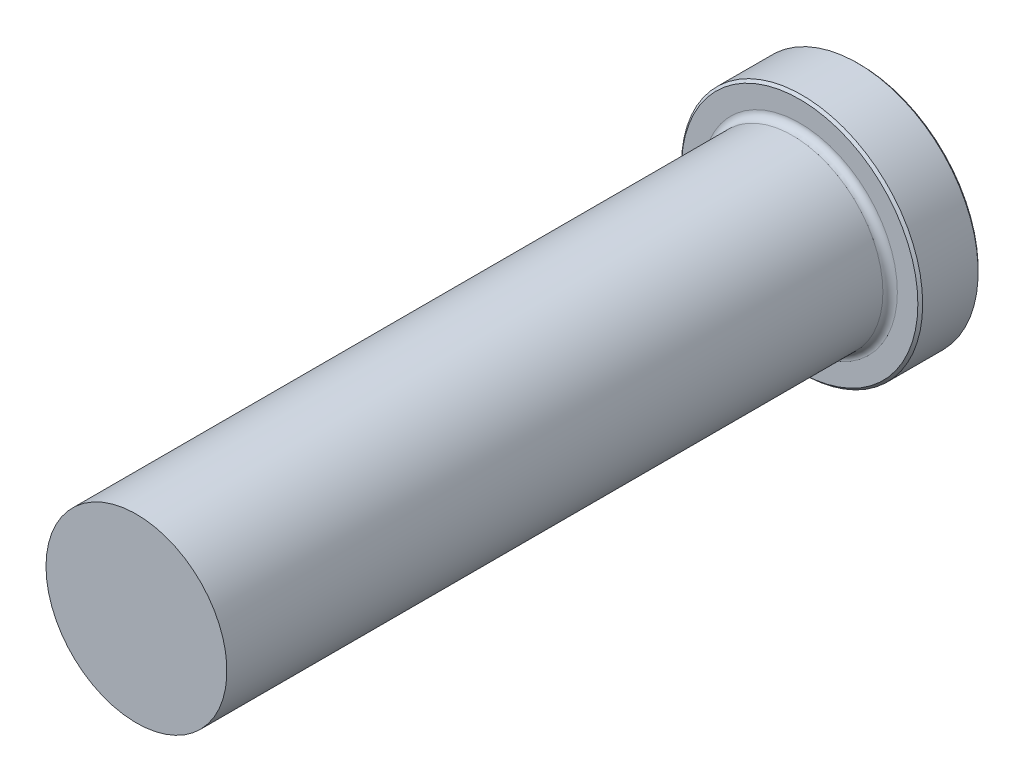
from build123d import *

# Parameters (mm, degrees)
FILLET1_R     = 0.762
CHAMFER1_SIZE = 0.254


with BuildPart() as part:
    # Sketch1 → Revolve1 (revolve)
    with BuildSketch(Plane(origin=(0, 0, 0), x_dir=(0, 0, -1), z_dir=(1, 0, 0)), mode=Mode.PRIVATE) as revolve1_sk:
        Polygon((0, 0), (0, 12.7), (-6.35, 12.7), (-6.35, 9.525), (-76.2, 9.525), (-76.2, 0), align=None)
    revolve(revolve1_sk.sketch.rotate(Axis((0, 0, 0), (0, 0, 1)), 90), axis=Axis((0, 0, 0), (0, 0, 1)))

    # Fillet1
    fillet1_edges = [part.edges().sort_by_distance(p)[0] for p in [
        (9.525, 0, 6.35),
    ]]
    fillet(fillet1_edges, radius=FILLET1_R)

    # Chamfer1
    chamfer1_edges = [part.edges().sort_by_distance(p)[0] for p in [
        (12.7, 0, 6.35),
        (12.7, 0, 0),
    ]]
    chamfer(chamfer1_edges, length=CHAMFER1_SIZE)


solid = part.part
